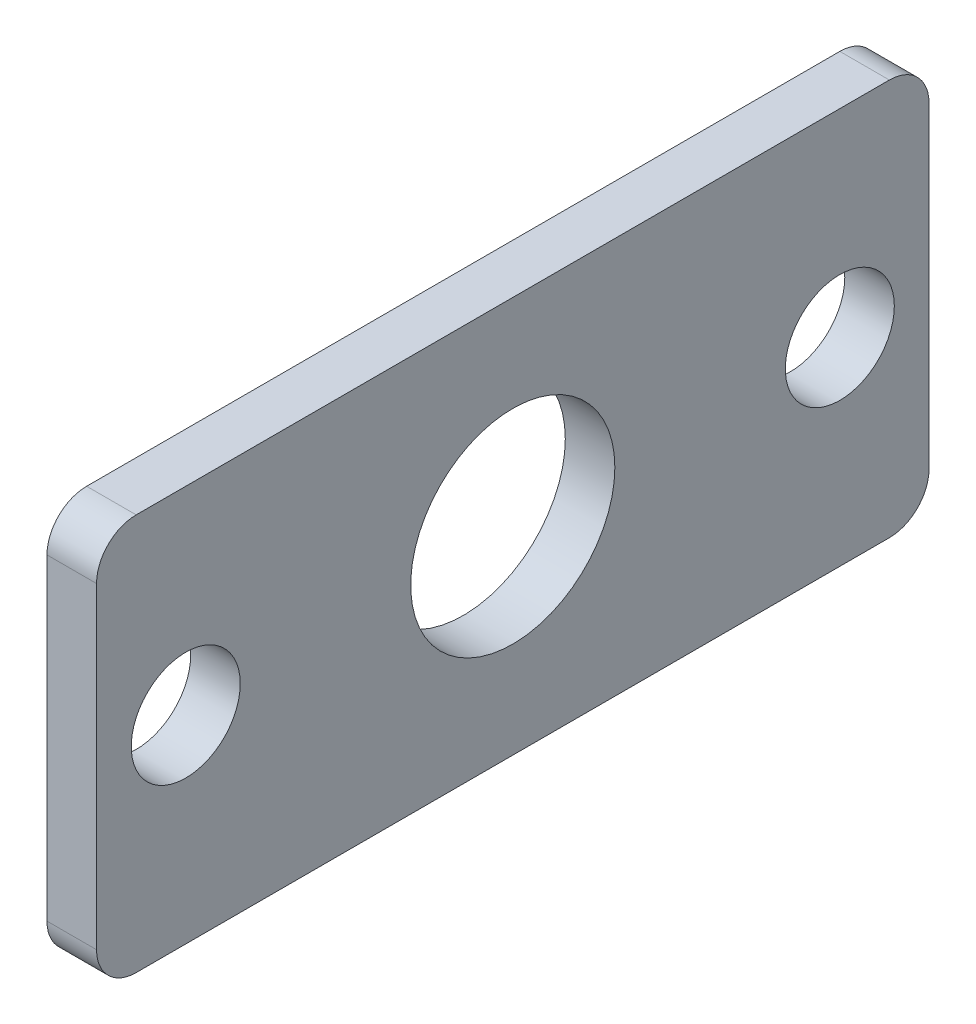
from build123d import *

# Parameters (mm, degrees)
SKETCH_1_R          = 2.75
EXTRUDE_1_DEPTH     = 2.5
SKETCH_2_R          = 5.15
CUT_EXTRUDE_1_DEPTH = 2.5


with BuildPart() as part:
    # Sketch 1 → Extrude 1 (new body)
    with BuildSketch(Plane(origin=(0, 0, 0), x_dir=(0, 0, -1), z_dir=(1, 0, 0))):
        with BuildLine():
            Line((0, 18), (0, 2))
            ThreePointArc((0, 2), (0.585786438, 0.585786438), (2, 0))
            Line((2, 0), (40, 0))
            ThreePointArc((40, 0), (41.414213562, 0.585786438), (42, 2))
            Line((42, 2), (42, 18))
            ThreePointArc((42, 18), (41.414213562, 19.414213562), (40, 20))
            Line((40, 20), (2, 20))
            ThreePointArc((2, 20), (0.585786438, 19.414213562), (0, 18))
        make_face()
        with Locations((37.5, 10)):
            Circle(SKETCH_1_R, mode=Mode.SUBTRACT)
        with Locations((4.5, 10)):
            Circle(SKETCH_1_R, mode=Mode.SUBTRACT)
    extrude(amount=EXTRUDE_1_DEPTH)

    # Sketch 2 → Cut-Extrude 1 (cut)
    with BuildSketch(Plane(origin=(2.5, 0, 0), x_dir=(0, 0, -1), z_dir=(1, 0, 0))):
        with Locations((21, 10)):
            Circle(SKETCH_2_R)
    extrude(amount=-CUT_EXTRUDE_1_DEPTH, mode=Mode.SUBTRACT)


solid = part.part
